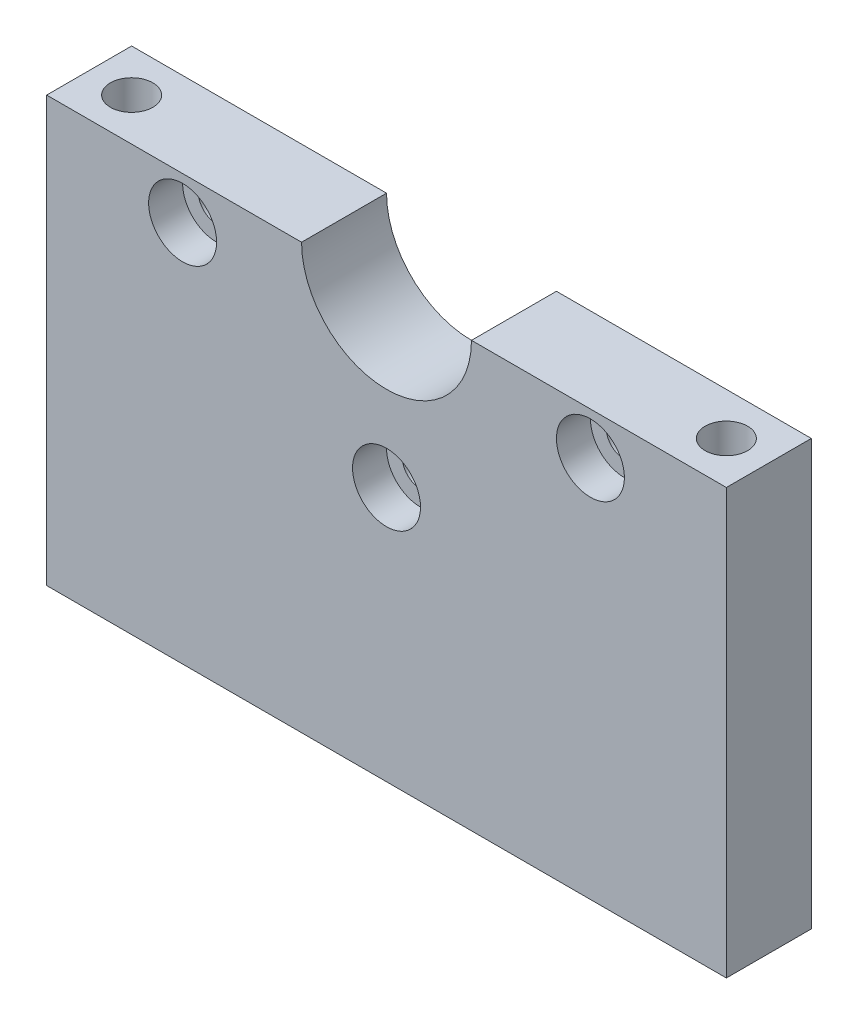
ISO-10303-21;
HEADER;
FILE_DESCRIPTION(('STEP AP214'),'2;1');
FILE_NAME('part.step','',(''),(''),'','','');
FILE_SCHEMA(('AUTOMOTIVE_DESIGN { 1 0 10303 214 1 1 1 1 }'));
ENDSEC;
DATA;
#1=APPLICATION_CONTEXT('core data for automotive mechanical design processes');
#2=APPLICATION_PROTOCOL_DEFINITION('international standard','automotive_design',2000,#1);
#3=PRODUCT_CONTEXT('',#1,'mechanical');
#4=PRODUCT('Part','Part','',(#3));
#5=PRODUCT_RELATED_PRODUCT_CATEGORY('part','',(#4));
#6=PRODUCT_DEFINITION_FORMATION('','',#4);
#7=PRODUCT_DEFINITION_CONTEXT('part definition',#1,'design');
#8=PRODUCT_DEFINITION('design','',#6,#7);
#9=PRODUCT_DEFINITION_SHAPE('','',#8);
#10=(LENGTH_UNIT() NAMED_UNIT(*) SI_UNIT(.MILLI.,.METRE.));
#11=(NAMED_UNIT(*) PLANE_ANGLE_UNIT() SI_UNIT($,.RADIAN.));
#12=(NAMED_UNIT(*) SI_UNIT($,.STERADIAN.) SOLID_ANGLE_UNIT());
#13=UNCERTAINTY_MEASURE_WITH_UNIT(LENGTH_MEASURE(1.E-05),#10,'distance_accuracy_value','');
#14=(GEOMETRIC_REPRESENTATION_CONTEXT(3) GLOBAL_UNCERTAINTY_ASSIGNED_CONTEXT((#13)) GLOBAL_UNIT_ASSIGNED_CONTEXT((#10,
#11,#12)) REPRESENTATION_CONTEXT('',''));
#15=CARTESIAN_POINT('',(0.,0.,0.));
#16=DIRECTION('',(0.,0.,1.));
#17=DIRECTION('',(1.,0.,0.));
#18=AXIS2_PLACEMENT_3D('',#15,#16,#17);
#19=CARTESIAN_POINT('',(-40.,25.,5.));
#20=DIRECTION('',(0.,-1.,0.));
#21=DIRECTION('',(0.,0.,-1.));
#22=AXIS2_PLACEMENT_3D('',#19,#20,#21);
#23=PLANE('',#22);
#24=CARTESIAN_POINT('',(35.,25.,0.));
#25=DIRECTION('',(0.,1.,0.));
#26=DIRECTION('',(0.,0.,1.));
#27=AXIS2_PLACEMENT_3D('',#24,#25,#26);
#28=CIRCLE('',#27,2.5);
#29=CARTESIAN_POINT('',(35.,25.,2.5));
#30=VERTEX_POINT('',#29);
#31=EDGE_CURVE('E116',#30,#30,#28,.T.);
#32=ORIENTED_EDGE('',*,*,#31,.F.);
#33=EDGE_LOOP('',(#32));
#34=FACE_BOUND('',#33,.T.);
#35=DIRECTION('',(-1.,0.,0.));
#36=VECTOR('',#35,1.);
#37=CARTESIAN_POINT('',(-40.,25.,-5.));
#38=LINE('',#37,#36);
#39=CARTESIAN_POINT('',(40.,25.,-5.));
#40=VERTEX_POINT('',#39);
#41=CARTESIAN_POINT('',(10.,25.,-5.));
#42=VERTEX_POINT('',#41);
#43=EDGE_CURVE('E194',#40,#42,#38,.T.);
#44=ORIENTED_EDGE('',*,*,#43,.T.);
#45=DIRECTION('',(0.,0.,1.));
#46=VECTOR('',#45,1.);
#47=CARTESIAN_POINT('',(10.,25.,-5.001));
#48=LINE('',#47,#46);
#49=CARTESIAN_POINT('',(10.,25.,5.));
#50=VERTEX_POINT('',#49);
#51=EDGE_CURVE('E49',#50,#42,#48,.F.);
#52=ORIENTED_EDGE('',*,*,#51,.F.);
#53=DIRECTION('',(-1.,0.,0.));
#54=VECTOR('',#53,1.);
#55=CARTESIAN_POINT('',(-40.,25.,5.));
#56=LINE('',#55,#54);
#57=CARTESIAN_POINT('',(40.,25.,5.));
#58=VERTEX_POINT('',#57);
#59=EDGE_CURVE('E85',#58,#50,#56,.T.);
#60=ORIENTED_EDGE('',*,*,#59,.F.);
#61=DIRECTION('',(0.,0.,-1.));
#62=VECTOR('',#61,1.);
#63=CARTESIAN_POINT('',(40.,25.,5.));
#64=LINE('',#63,#62);
#65=EDGE_CURVE('E11',#58,#40,#64,.T.);
#66=ORIENTED_EDGE('',*,*,#65,.T.);
#67=EDGE_LOOP('',(#44,#52,#60,#66));
#68=FACE_BOUND('',#67,.T.);
#69=ADVANCED_FACE('F34',(#34,#68),#23,.F.);
#70=CARTESIAN_POINT('',(40.,-25.,5.));
#71=DIRECTION('',(-1.,0.,0.));
#72=DIRECTION('',(0.,0.,1.));
#73=AXIS2_PLACEMENT_3D('',#70,#71,#72);
#74=PLANE('',#73);
#75=DIRECTION('',(0.,1.,0.));
#76=VECTOR('',#75,1.);
#77=CARTESIAN_POINT('',(40.,-25.,-5.));
#78=LINE('',#77,#76);
#79=CARTESIAN_POINT('',(40.,-25.,-5.));
#80=VERTEX_POINT('',#79);
#81=EDGE_CURVE('E182',#80,#40,#78,.T.);
#82=ORIENTED_EDGE('',*,*,#81,.T.);
#83=ORIENTED_EDGE('',*,*,#65,.F.);
#84=DIRECTION('',(0.,1.,0.));
#85=VECTOR('',#84,1.);
#86=CARTESIAN_POINT('',(40.,-25.,5.));
#87=LINE('',#86,#85);
#88=CARTESIAN_POINT('',(40.,-25.,5.));
#89=VERTEX_POINT('',#88);
#90=EDGE_CURVE('E183',#89,#58,#87,.T.);
#91=ORIENTED_EDGE('',*,*,#90,.F.);
#92=DIRECTION('',(0.,0.,-1.));
#93=VECTOR('',#92,1.);
#94=CARTESIAN_POINT('',(40.,-25.,5.));
#95=LINE('',#94,#93);
#96=EDGE_CURVE('E190',#89,#80,#95,.T.);
#97=ORIENTED_EDGE('',*,*,#96,.T.);
#98=EDGE_LOOP('',(#82,#83,#91,#97));
#99=FACE_BOUND('',#98,.T.);
#100=ADVANCED_FACE('F36',(#99),#74,.F.);
#101=CARTESIAN_POINT('',(-35.,25.,0.));
#102=DIRECTION('',(0.,1.,0.));
#103=DIRECTION('',(0.,0.,1.));
#104=AXIS2_PLACEMENT_3D('',#101,#102,#103);
#105=CIRCLE('',#104,2.5);
#106=CARTESIAN_POINT('',(-35.,25.,2.50000000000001));
#107=VERTEX_POINT('',#106);
#108=EDGE_CURVE('E117',#107,#107,#105,.T.);
#109=ORIENTED_EDGE('',*,*,#108,.F.);
#110=EDGE_LOOP('',(#109));
#111=FACE_BOUND('',#110,.T.);
#112=CARTESIAN_POINT('',(-10.,25.,5.));
#113=VERTEX_POINT('',#112);
#114=CARTESIAN_POINT('',(-40.,25.,5.));
#115=VERTEX_POINT('',#114);
#116=EDGE_CURVE('E185',#113,#115,#56,.T.);
#117=ORIENTED_EDGE('',*,*,#116,.F.);
#118=DIRECTION('',(0.,0.,1.));
#119=VECTOR('',#118,1.);
#120=CARTESIAN_POINT('',(-10.,25.,-5.001));
#121=LINE('',#120,#119);
#122=CARTESIAN_POINT('',(-10.,25.,-5.));
#123=VERTEX_POINT('',#122);
#124=EDGE_CURVE('E175',#123,#113,#121,.T.);
#125=ORIENTED_EDGE('',*,*,#124,.F.);
#126=CARTESIAN_POINT('',(-40.,25.,-5.));
#127=VERTEX_POINT('',#126);
#128=EDGE_CURVE('E193',#123,#127,#38,.T.);
#129=ORIENTED_EDGE('',*,*,#128,.T.);
#130=DIRECTION('',(0.,0.,-1.));
#131=VECTOR('',#130,1.);
#132=CARTESIAN_POINT('',(-40.,25.,5.));
#133=LINE('',#132,#131);
#134=EDGE_CURVE('E42',#115,#127,#133,.T.);
#135=ORIENTED_EDGE('',*,*,#134,.F.);
#136=EDGE_LOOP('',(#117,#125,#129,#135));
#137=FACE_BOUND('',#136,.T.);
#138=ADVANCED_FACE('F229',(#111,#137),#23,.F.);
#139=CARTESIAN_POINT('',(-40.,-25.,5.));
#140=DIRECTION('',(1.,0.,0.));
#141=DIRECTION('',(0.,0.,-1.));
#142=AXIS2_PLACEMENT_3D('',#139,#140,#141);
#143=PLANE('',#142);
#144=DIRECTION('',(0.,-1.,0.));
#145=VECTOR('',#144,1.);
#146=CARTESIAN_POINT('',(-40.,-25.,-5.));
#147=LINE('',#146,#145);
#148=CARTESIAN_POINT('',(-40.,-25.,-5.));
#149=VERTEX_POINT('',#148);
#150=EDGE_CURVE('E197',#127,#149,#147,.T.);
#151=ORIENTED_EDGE('',*,*,#150,.T.);
#152=DIRECTION('',(0.,0.,-1.));
#153=VECTOR('',#152,1.);
#154=CARTESIAN_POINT('',(-40.,-25.,5.));
#155=LINE('',#154,#153);
#156=CARTESIAN_POINT('',(-40.,-25.,5.));
#157=VERTEX_POINT('',#156);
#158=EDGE_CURVE('E201',#157,#149,#155,.T.);
#159=ORIENTED_EDGE('',*,*,#158,.F.);
#160=DIRECTION('',(0.,-1.,0.));
#161=VECTOR('',#160,1.);
#162=CARTESIAN_POINT('',(-40.,-25.,5.));
#163=LINE('',#162,#161);
#164=EDGE_CURVE('E187',#115,#157,#163,.T.);
#165=ORIENTED_EDGE('',*,*,#164,.F.);
#166=ORIENTED_EDGE('',*,*,#134,.T.);
#167=EDGE_LOOP('',(#151,#159,#165,#166));
#168=FACE_BOUND('',#167,.T.);
#169=ADVANCED_FACE('F207',(#168),#143,.F.);
#170=CARTESIAN_POINT('',(-40.,-25.,5.));
#171=DIRECTION('',(0.,1.,0.));
#172=DIRECTION('',(0.,0.,1.));
#173=AXIS2_PLACEMENT_3D('',#170,#171,#172);
#174=PLANE('',#173);
#175=CARTESIAN_POINT('',(-25.,-25.,0.));
#176=DIRECTION('',(0.,-1.,0.));
#177=DIRECTION('',(0.,0.,-1.));
#178=AXIS2_PLACEMENT_3D('',#175,#176,#177);
#179=CIRCLE('',#178,1.65);
#180=CARTESIAN_POINT('',(-25.,-25.,-1.65));
#181=VERTEX_POINT('',#180);
#182=EDGE_CURVE('E127',#181,#181,#179,.T.);
#183=ORIENTED_EDGE('',*,*,#182,.F.);
#184=EDGE_LOOP('',(#183));
#185=FACE_BOUND('',#184,.T.);
#186=CARTESIAN_POINT('',(25.,-25.,0.));
#187=DIRECTION('',(0.,-1.,0.));
#188=DIRECTION('',(0.,0.,-1.));
#189=AXIS2_PLACEMENT_3D('',#186,#187,#188);
#190=CIRCLE('',#189,1.65);
#191=CARTESIAN_POINT('',(25.,-25.,-1.65));
#192=VERTEX_POINT('',#191);
#193=EDGE_CURVE('E133',#192,#192,#190,.T.);
#194=ORIENTED_EDGE('',*,*,#193,.F.);
#195=EDGE_LOOP('',(#194));
#196=FACE_BOUND('',#195,.T.);
#197=DIRECTION('',(1.,0.,0.));
#198=VECTOR('',#197,1.);
#199=CARTESIAN_POINT('',(-40.,-25.,-5.));
#200=LINE('',#199,#198);
#201=EDGE_CURVE('E79',#149,#80,#200,.T.);
#202=ORIENTED_EDGE('',*,*,#201,.T.);
#203=ORIENTED_EDGE('',*,*,#96,.F.);
#204=DIRECTION('',(1.,0.,0.));
#205=VECTOR('',#204,1.);
#206=CARTESIAN_POINT('',(-40.,-25.,5.));
#207=LINE('',#206,#205);
#208=EDGE_CURVE('E58',#157,#89,#207,.T.);
#209=ORIENTED_EDGE('',*,*,#208,.F.);
#210=ORIENTED_EDGE('',*,*,#158,.T.);
#211=EDGE_LOOP('',(#202,#203,#209,#210));
#212=FACE_BOUND('',#211,.T.);
#213=ADVANCED_FACE('F218',(#185,#196,#212),#174,.F.);
#214=CARTESIAN_POINT('',(0.,0.,5.));
#215=DIRECTION('',(0.,0.,-1.));
#216=DIRECTION('',(-1.,0.,0.));
#217=AXIS2_PLACEMENT_3D('',#214,#215,#216);
#218=PLANE('',#217);
#219=CARTESIAN_POINT('',(-24.,20.,5.));
#220=DIRECTION('',(0.,0.,1.));
#221=DIRECTION('',(1.,0.,0.));
#222=AXIS2_PLACEMENT_3D('',#219,#220,#221);
#223=CIRCLE('',#222,4.);
#224=CARTESIAN_POINT('',(-20.,20.,5.));
#225=VERTEX_POINT('',#224);
#226=EDGE_CURVE('E139',#225,#225,#223,.T.);
#227=ORIENTED_EDGE('',*,*,#226,.F.);
#228=EDGE_LOOP('',(#227));
#229=FACE_BOUND('',#228,.T.);
#230=CARTESIAN_POINT('',(0.,5.,5.));
#231=DIRECTION('',(0.,0.,1.));
#232=DIRECTION('',(1.,0.,0.));
#233=AXIS2_PLACEMENT_3D('',#230,#231,#232);
#234=CIRCLE('',#233,4.);
#235=CARTESIAN_POINT('',(4.,5.,5.));
#236=VERTEX_POINT('',#235);
#237=EDGE_CURVE('E151',#236,#236,#234,.T.);
#238=ORIENTED_EDGE('',*,*,#237,.F.);
#239=EDGE_LOOP('',(#238));
#240=FACE_BOUND('',#239,.T.);
#241=CARTESIAN_POINT('',(24.,20.,5.));
#242=DIRECTION('',(0.,0.,1.));
#243=DIRECTION('',(1.,0.,0.));
#244=AXIS2_PLACEMENT_3D('',#241,#242,#243);
#245=CIRCLE('',#244,4.);
#246=CARTESIAN_POINT('',(28.,20.,5.));
#247=VERTEX_POINT('',#246);
#248=EDGE_CURVE('E163',#247,#247,#245,.T.);
#249=ORIENTED_EDGE('',*,*,#248,.F.);
#250=EDGE_LOOP('',(#249));
#251=FACE_BOUND('',#250,.T.);
#252=ORIENTED_EDGE('',*,*,#59,.T.);
#253=CARTESIAN_POINT('',(0.,25.,5.));
#254=DIRECTION('',(0.,0.,1.));
#255=DIRECTION('',(1.,0.,0.));
#256=AXIS2_PLACEMENT_3D('',#253,#254,#255);
#257=CIRCLE('',#256,10.);
#258=EDGE_CURVE('E178',#113,#50,#257,.T.);
#259=ORIENTED_EDGE('',*,*,#258,.F.);
#260=ORIENTED_EDGE('',*,*,#116,.T.);
#261=ORIENTED_EDGE('',*,*,#164,.T.);
#262=ORIENTED_EDGE('',*,*,#208,.T.);
#263=ORIENTED_EDGE('',*,*,#90,.T.);
#264=EDGE_LOOP('',(#252,#259,#260,#261,#262,#263));
#265=FACE_BOUND('',#264,.T.);
#266=ADVANCED_FACE('F220',(#229,#240,#251,#265),#218,.F.);
#267=CARTESIAN_POINT('',(0.,0.,-5.));
#268=DIRECTION('',(0.,0.,-1.));
#269=DIRECTION('',(-1.,0.,0.));
#270=AXIS2_PLACEMENT_3D('',#267,#268,#269);
#271=PLANE('',#270);
#272=CARTESIAN_POINT('',(-24.,20.,-5.));
#273=DIRECTION('',(0.,0.,1.));
#274=DIRECTION('',(1.,0.,0.));
#275=AXIS2_PLACEMENT_3D('',#272,#273,#274);
#276=CIRCLE('',#275,2.15);
#277=CARTESIAN_POINT('',(-21.85,20.,-5.));
#278=VERTEX_POINT('',#277);
#279=EDGE_CURVE('E148',#278,#278,#276,.T.);
#280=ORIENTED_EDGE('',*,*,#279,.T.);
#281=EDGE_LOOP('',(#280));
#282=FACE_BOUND('',#281,.T.);
#283=CARTESIAN_POINT('',(0.,5.,-5.));
#284=DIRECTION('',(0.,0.,1.));
#285=DIRECTION('',(1.,0.,0.));
#286=AXIS2_PLACEMENT_3D('',#283,#284,#285);
#287=CIRCLE('',#286,2.15);
#288=CARTESIAN_POINT('',(2.15,5.,-5.));
#289=VERTEX_POINT('',#288);
#290=EDGE_CURVE('E160',#289,#289,#287,.T.);
#291=ORIENTED_EDGE('',*,*,#290,.T.);
#292=EDGE_LOOP('',(#291));
#293=FACE_BOUND('',#292,.T.);
#294=CARTESIAN_POINT('',(24.,20.,-5.));
#295=DIRECTION('',(0.,0.,1.));
#296=DIRECTION('',(1.,0.,0.));
#297=AXIS2_PLACEMENT_3D('',#294,#295,#296);
#298=CIRCLE('',#297,2.15);
#299=CARTESIAN_POINT('',(26.15,20.,-5.));
#300=VERTEX_POINT('',#299);
#301=EDGE_CURVE('E172',#300,#300,#298,.T.);
#302=ORIENTED_EDGE('',*,*,#301,.T.);
#303=EDGE_LOOP('',(#302));
#304=FACE_BOUND('',#303,.T.);
#305=CARTESIAN_POINT('',(0.,25.,-5.));
#306=DIRECTION('',(0.,0.,-1.));
#307=DIRECTION('',(-1.,0.,0.));
#308=AXIS2_PLACEMENT_3D('',#305,#306,#307);
#309=CIRCLE('',#308,10.);
#310=EDGE_CURVE('E180',#123,#42,#309,.F.);
#311=ORIENTED_EDGE('',*,*,#310,.T.);
#312=ORIENTED_EDGE('',*,*,#43,.F.);
#313=ORIENTED_EDGE('',*,*,#81,.F.);
#314=ORIENTED_EDGE('',*,*,#201,.F.);
#315=ORIENTED_EDGE('',*,*,#150,.F.);
#316=ORIENTED_EDGE('',*,*,#128,.F.);
#317=EDGE_LOOP('',(#311,#312,#313,#314,#315,#316));
#318=FACE_BOUND('',#317,.T.);
#319=ADVANCED_FACE('F213',(#282,#293,#304,#318),#271,.T.);
#320=CARTESIAN_POINT('',(0.,25.,-5.001));
#321=DIRECTION('',(0.,0.,1.));
#322=DIRECTION('',(1.,0.,0.));
#323=AXIS2_PLACEMENT_3D('',#320,#321,#322);
#324=CYLINDRICAL_SURFACE('',#323,10.);
#325=ORIENTED_EDGE('',*,*,#51,.T.);
#326=ORIENTED_EDGE('',*,*,#310,.F.);
#327=ORIENTED_EDGE('',*,*,#124,.T.);
#328=ORIENTED_EDGE('',*,*,#258,.T.);
#329=EDGE_LOOP('',(#325,#326,#327,#328));
#330=FACE_BOUND('',#329,.T.);
#331=ADVANCED_FACE('F247',(#330),#324,.F.);
#332=CARTESIAN_POINT('',(24.,20.,5.));
#333=DIRECTION('',(0.,0.,1.));
#334=DIRECTION('',(1.,0.,0.));
#335=AXIS2_PLACEMENT_3D('',#332,#333,#334);
#336=CYLINDRICAL_SURFACE('',#335,2.15);
#337=ORIENTED_EDGE('',*,*,#301,.F.);
#338=EDGE_LOOP('',(#337));
#339=FACE_BOUND('',#338,.T.);
#340=CARTESIAN_POINT('',(24.,20.,1.));
#341=DIRECTION('',(0.,0.,1.));
#342=DIRECTION('',(1.,0.,0.));
#343=AXIS2_PLACEMENT_3D('',#340,#341,#342);
#344=CIRCLE('',#343,2.15);
#345=CARTESIAN_POINT('',(26.15,20.,1.));
#346=VERTEX_POINT('',#345);
#347=EDGE_CURVE('E169',#346,#346,#344,.T.);
#348=ORIENTED_EDGE('',*,*,#347,.T.);
#349=EDGE_LOOP('',(#348));
#350=FACE_BOUND('',#349,.T.);
#351=ADVANCED_FACE('F249',(#339,#350),#336,.F.);
#352=CARTESIAN_POINT('',(26.15,20.,1.));
#353=DIRECTION('',(0.,0.,-1.));
#354=DIRECTION('',(-1.,0.,0.));
#355=AXIS2_PLACEMENT_3D('',#352,#353,#354);
#356=PLANE('',#355);
#357=ORIENTED_EDGE('',*,*,#347,.F.);
#358=EDGE_LOOP('',(#357));
#359=FACE_BOUND('',#358,.T.);
#360=CARTESIAN_POINT('',(24.,20.,1.));
#361=DIRECTION('',(0.,0.,1.));
#362=DIRECTION('',(1.,0.,0.));
#363=AXIS2_PLACEMENT_3D('',#360,#361,#362);
#364=CIRCLE('',#363,4.);
#365=CARTESIAN_POINT('',(28.,20.,1.));
#366=VERTEX_POINT('',#365);
#367=EDGE_CURVE('E166',#366,#366,#364,.T.);
#368=ORIENTED_EDGE('',*,*,#367,.T.);
#369=EDGE_LOOP('',(#368));
#370=FACE_BOUND('',#369,.T.);
#371=ADVANCED_FACE('F255',(#359,#370),#356,.F.);
#372=CARTESIAN_POINT('',(24.,20.,5.));
#373=DIRECTION('',(0.,0.,1.));
#374=DIRECTION('',(1.,0.,0.));
#375=AXIS2_PLACEMENT_3D('',#372,#373,#374);
#376=CYLINDRICAL_SURFACE('',#375,4.);
#377=ORIENTED_EDGE('',*,*,#367,.F.);
#378=EDGE_LOOP('',(#377));
#379=FACE_BOUND('',#378,.T.);
#380=ORIENTED_EDGE('',*,*,#248,.T.);
#381=EDGE_LOOP('',(#380));
#382=FACE_BOUND('',#381,.T.);
#383=ADVANCED_FACE('F262',(#379,#382),#376,.F.);
#384=CARTESIAN_POINT('',(0.,5.,5.));
#385=DIRECTION('',(0.,0.,1.));
#386=DIRECTION('',(1.,0.,0.));
#387=AXIS2_PLACEMENT_3D('',#384,#385,#386);
#388=CYLINDRICAL_SURFACE('',#387,2.15);
#389=ORIENTED_EDGE('',*,*,#290,.F.);
#390=EDGE_LOOP('',(#389));
#391=FACE_BOUND('',#390,.T.);
#392=CARTESIAN_POINT('',(0.,5.,1.));
#393=DIRECTION('',(0.,0.,1.));
#394=DIRECTION('',(1.,0.,0.));
#395=AXIS2_PLACEMENT_3D('',#392,#393,#394);
#396=CIRCLE('',#395,2.15);
#397=CARTESIAN_POINT('',(2.15,5.,1.));
#398=VERTEX_POINT('',#397);
#399=EDGE_CURVE('E157',#398,#398,#396,.T.);
#400=ORIENTED_EDGE('',*,*,#399,.T.);
#401=EDGE_LOOP('',(#400));
#402=FACE_BOUND('',#401,.T.);
#403=ADVANCED_FACE('F266',(#391,#402),#388,.F.);
#404=CARTESIAN_POINT('',(2.15,5.,1.));
#405=DIRECTION('',(0.,0.,-1.));
#406=DIRECTION('',(-1.,0.,0.));
#407=AXIS2_PLACEMENT_3D('',#404,#405,#406);
#408=PLANE('',#407);
#409=ORIENTED_EDGE('',*,*,#399,.F.);
#410=EDGE_LOOP('',(#409));
#411=FACE_BOUND('',#410,.T.);
#412=CARTESIAN_POINT('',(0.,5.,1.));
#413=DIRECTION('',(0.,0.,1.));
#414=DIRECTION('',(1.,0.,0.));
#415=AXIS2_PLACEMENT_3D('',#412,#413,#414);
#416=CIRCLE('',#415,4.);
#417=CARTESIAN_POINT('',(4.,5.,1.));
#418=VERTEX_POINT('',#417);
#419=EDGE_CURVE('E154',#418,#418,#416,.T.);
#420=ORIENTED_EDGE('',*,*,#419,.T.);
#421=EDGE_LOOP('',(#420));
#422=FACE_BOUND('',#421,.T.);
#423=ADVANCED_FACE('F270',(#411,#422),#408,.F.);
#424=CARTESIAN_POINT('',(0.,5.,5.));
#425=DIRECTION('',(0.,0.,1.));
#426=DIRECTION('',(1.,0.,0.));
#427=AXIS2_PLACEMENT_3D('',#424,#425,#426);
#428=CYLINDRICAL_SURFACE('',#427,4.);
#429=ORIENTED_EDGE('',*,*,#419,.F.);
#430=EDGE_LOOP('',(#429));
#431=FACE_BOUND('',#430,.T.);
#432=ORIENTED_EDGE('',*,*,#237,.T.);
#433=EDGE_LOOP('',(#432));
#434=FACE_BOUND('',#433,.T.);
#435=ADVANCED_FACE('F274',(#431,#434),#428,.F.);
#436=CARTESIAN_POINT('',(-24.,20.,5.));
#437=DIRECTION('',(0.,0.,1.));
#438=DIRECTION('',(1.,0.,0.));
#439=AXIS2_PLACEMENT_3D('',#436,#437,#438);
#440=CYLINDRICAL_SURFACE('',#439,2.15);
#441=ORIENTED_EDGE('',*,*,#279,.F.);
#442=EDGE_LOOP('',(#441));
#443=FACE_BOUND('',#442,.T.);
#444=CARTESIAN_POINT('',(-24.,20.,1.));
#445=DIRECTION('',(0.,0.,1.));
#446=DIRECTION('',(1.,0.,0.));
#447=AXIS2_PLACEMENT_3D('',#444,#445,#446);
#448=CIRCLE('',#447,2.15);
#449=CARTESIAN_POINT('',(-21.85,20.,1.));
#450=VERTEX_POINT('',#449);
#451=EDGE_CURVE('E145',#450,#450,#448,.T.);
#452=ORIENTED_EDGE('',*,*,#451,.T.);
#453=EDGE_LOOP('',(#452));
#454=FACE_BOUND('',#453,.T.);
#455=ADVANCED_FACE('F278',(#443,#454),#440,.F.);
#456=CARTESIAN_POINT('',(-21.85,20.,1.));
#457=DIRECTION('',(0.,0.,-1.));
#458=DIRECTION('',(-1.,0.,0.));
#459=AXIS2_PLACEMENT_3D('',#456,#457,#458);
#460=PLANE('',#459);
#461=ORIENTED_EDGE('',*,*,#451,.F.);
#462=EDGE_LOOP('',(#461));
#463=FACE_BOUND('',#462,.T.);
#464=CARTESIAN_POINT('',(-24.,20.,1.));
#465=DIRECTION('',(0.,0.,1.));
#466=DIRECTION('',(1.,0.,0.));
#467=AXIS2_PLACEMENT_3D('',#464,#465,#466);
#468=CIRCLE('',#467,4.);
#469=CARTESIAN_POINT('',(-20.,20.,1.));
#470=VERTEX_POINT('',#469);
#471=EDGE_CURVE('E142',#470,#470,#468,.T.);
#472=ORIENTED_EDGE('',*,*,#471,.T.);
#473=EDGE_LOOP('',(#472));
#474=FACE_BOUND('',#473,.T.);
#475=ADVANCED_FACE('F282',(#463,#474),#460,.F.);
#476=CARTESIAN_POINT('',(-24.,20.,5.));
#477=DIRECTION('',(0.,0.,1.));
#478=DIRECTION('',(1.,0.,0.));
#479=AXIS2_PLACEMENT_3D('',#476,#477,#478);
#480=CYLINDRICAL_SURFACE('',#479,4.);
#481=ORIENTED_EDGE('',*,*,#471,.F.);
#482=EDGE_LOOP('',(#481));
#483=FACE_BOUND('',#482,.T.);
#484=ORIENTED_EDGE('',*,*,#226,.T.);
#485=EDGE_LOOP('',(#484));
#486=FACE_BOUND('',#485,.T.);
#487=ADVANCED_FACE('F286',(#483,#486),#480,.F.);
#488=CARTESIAN_POINT('',(25.,-15.,0.));
#489=DIRECTION('',(0.,-1.,0.));
#490=DIRECTION('',(0.,0.,-1.));
#491=AXIS2_PLACEMENT_3D('',#488,#489,#490);
#492=CONICAL_SURFACE('',#491,1.65,1.02974425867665);
#493=CARTESIAN_POINT('',(25.,-14.0085799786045,0.));
#494=VERTEX_POINT('',#493);
#495=VERTEX_LOOP('',#494);
#496=FACE_BOUND('',#495,.T.);
#497=CARTESIAN_POINT('',(25.,-15.,0.));
#498=DIRECTION('',(0.,-1.,0.));
#499=DIRECTION('',(0.,0.,-1.));
#500=AXIS2_PLACEMENT_3D('',#497,#498,#499);
#501=CIRCLE('',#500,1.65);
#502=CARTESIAN_POINT('',(25.,-15.,-1.65));
#503=VERTEX_POINT('',#502);
#504=EDGE_CURVE('E136',#503,#503,#501,.T.);
#505=ORIENTED_EDGE('',*,*,#504,.T.);
#506=EDGE_LOOP('',(#505));
#507=FACE_BOUND('',#506,.T.);
#508=ADVANCED_FACE('F290',(#496,#507),#492,.F.);
#509=CARTESIAN_POINT('',(25.,-25.,0.));
#510=DIRECTION('',(0.,-1.,0.));
#511=DIRECTION('',(0.,0.,-1.));
#512=AXIS2_PLACEMENT_3D('',#509,#510,#511);
#513=CYLINDRICAL_SURFACE('',#512,1.65);
#514=ORIENTED_EDGE('',*,*,#504,.F.);
#515=EDGE_LOOP('',(#514));
#516=FACE_BOUND('',#515,.T.);
#517=ORIENTED_EDGE('',*,*,#193,.T.);
#518=EDGE_LOOP('',(#517));
#519=FACE_BOUND('',#518,.T.);
#520=ADVANCED_FACE('F294',(#516,#519),#513,.F.);
#521=CARTESIAN_POINT('',(-25.,-15.,0.));
#522=DIRECTION('',(0.,-1.,0.));
#523=DIRECTION('',(0.,0.,-1.));
#524=AXIS2_PLACEMENT_3D('',#521,#522,#523);
#525=CONICAL_SURFACE('',#524,1.65,1.02974425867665);
#526=CARTESIAN_POINT('',(-25.,-14.0085799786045,0.));
#527=VERTEX_POINT('',#526);
#528=VERTEX_LOOP('',#527);
#529=FACE_BOUND('',#528,.T.);
#530=CARTESIAN_POINT('',(-25.,-15.,0.));
#531=DIRECTION('',(0.,-1.,0.));
#532=DIRECTION('',(0.,0.,-1.));
#533=AXIS2_PLACEMENT_3D('',#530,#531,#532);
#534=CIRCLE('',#533,1.65);
#535=CARTESIAN_POINT('',(-25.,-15.,-1.65));
#536=VERTEX_POINT('',#535);
#537=EDGE_CURVE('E130',#536,#536,#534,.T.);
#538=ORIENTED_EDGE('',*,*,#537,.T.);
#539=EDGE_LOOP('',(#538));
#540=FACE_BOUND('',#539,.T.);
#541=ADVANCED_FACE('F298',(#529,#540),#525,.F.);
#542=CARTESIAN_POINT('',(-25.,-25.,0.));
#543=DIRECTION('',(0.,-1.,0.));
#544=DIRECTION('',(0.,0.,-1.));
#545=AXIS2_PLACEMENT_3D('',#542,#543,#544);
#546=CYLINDRICAL_SURFACE('',#545,1.65);
#547=ORIENTED_EDGE('',*,*,#537,.F.);
#548=EDGE_LOOP('',(#547));
#549=FACE_BOUND('',#548,.T.);
#550=ORIENTED_EDGE('',*,*,#182,.T.);
#551=EDGE_LOOP('',(#550));
#552=FACE_BOUND('',#551,.T.);
#553=ADVANCED_FACE('F302',(#549,#552),#546,.F.);
#554=CARTESIAN_POINT('',(35.,10.,0.));
#555=DIRECTION('',(0.,1.,0.));
#556=DIRECTION('',(0.,0.,1.));
#557=AXIS2_PLACEMENT_3D('',#554,#555,#556);
#558=CONICAL_SURFACE('',#557,2.5,1.02974425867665);
#559=CARTESIAN_POINT('',(35.,8.4978484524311,0.));
#560=VERTEX_POINT('',#559);
#561=VERTEX_LOOP('',#560);
#562=FACE_BOUND('',#561,.T.);
#563=CARTESIAN_POINT('',(35.,10.,0.));
#564=DIRECTION('',(0.,1.,0.));
#565=DIRECTION('',(0.,0.,1.));
#566=AXIS2_PLACEMENT_3D('',#563,#564,#565);
#567=CIRCLE('',#566,2.5);
#568=CARTESIAN_POINT('',(35.,10.,2.5));
#569=VERTEX_POINT('',#568);
#570=EDGE_CURVE('E120',#569,#569,#567,.T.);
#571=ORIENTED_EDGE('',*,*,#570,.T.);
#572=EDGE_LOOP('',(#571));
#573=FACE_BOUND('',#572,.T.);
#574=ADVANCED_FACE('F306',(#562,#573),#558,.F.);
#575=CARTESIAN_POINT('',(35.,25.,0.));
#576=DIRECTION('',(0.,1.,0.));
#577=DIRECTION('',(0.,0.,1.));
#578=AXIS2_PLACEMENT_3D('',#575,#576,#577);
#579=CYLINDRICAL_SURFACE('',#578,2.5);
#580=ORIENTED_EDGE('',*,*,#570,.F.);
#581=EDGE_LOOP('',(#580));
#582=FACE_BOUND('',#581,.T.);
#583=ORIENTED_EDGE('',*,*,#31,.T.);
#584=EDGE_LOOP('',(#583));
#585=FACE_BOUND('',#584,.T.);
#586=ADVANCED_FACE('F110',(#582,#585),#579,.F.);
#587=CARTESIAN_POINT('',(-35.,10.,0.));
#588=DIRECTION('',(0.,1.,0.));
#589=DIRECTION('',(0.,0.,1.));
#590=AXIS2_PLACEMENT_3D('',#587,#588,#589);
#591=CONICAL_SURFACE('',#590,2.5,1.02974425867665);
#592=CARTESIAN_POINT('',(-35.,8.4978484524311,0.));
#593=VERTEX_POINT('',#592);
#594=VERTEX_LOOP('',#593);
#595=FACE_BOUND('',#594,.T.);
#596=CARTESIAN_POINT('',(-35.,10.,0.));
#597=DIRECTION('',(0.,1.,0.));
#598=DIRECTION('',(0.,0.,1.));
#599=AXIS2_PLACEMENT_3D('',#596,#597,#598);
#600=CIRCLE('',#599,2.5);
#601=CARTESIAN_POINT('',(-35.,10.,2.5));
#602=VERTEX_POINT('',#601);
#603=EDGE_CURVE('E114',#602,#602,#600,.T.);
#604=ORIENTED_EDGE('',*,*,#603,.T.);
#605=EDGE_LOOP('',(#604));
#606=FACE_BOUND('',#605,.T.);
#607=ADVANCED_FACE('F106',(#595,#606),#591,.F.);
#608=CARTESIAN_POINT('',(-35.,25.,0.));
#609=DIRECTION('',(0.,1.,0.));
#610=DIRECTION('',(0.,0.,1.));
#611=AXIS2_PLACEMENT_3D('',#608,#609,#610);
#612=CYLINDRICAL_SURFACE('',#611,2.5);
#613=ORIENTED_EDGE('',*,*,#603,.F.);
#614=EDGE_LOOP('',(#613));
#615=FACE_BOUND('',#614,.T.);
#616=ORIENTED_EDGE('',*,*,#108,.T.);
#617=EDGE_LOOP('',(#616));
#618=FACE_BOUND('',#617,.T.);
#619=ADVANCED_FACE('F109',(#615,#618),#612,.F.);
#620=CLOSED_SHELL('',(#69,#100,#138,#169,#213,#266,#319,#331,#351,#371,#383,#403,#423,#435,#455,
#475,#487,#508,#520,#541,#553,#574,#586,#607,#619));
#621=MANIFOLD_SOLID_BREP('B2',#620);
#622=ADVANCED_BREP_SHAPE_REPRESENTATION('',(#18,#621),#14);
#623=SHAPE_DEFINITION_REPRESENTATION(#9,#622);
ENDSEC;
END-ISO-10303-21;
